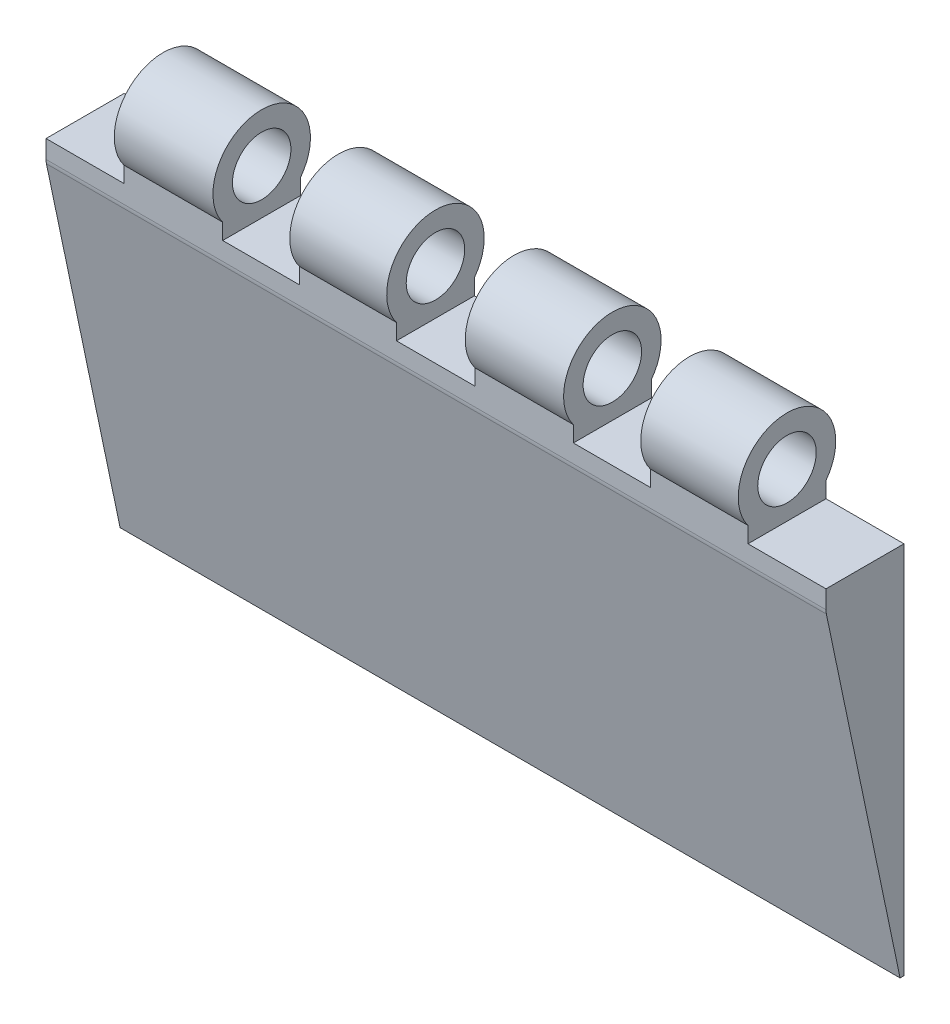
ISO-10303-21;
HEADER;
FILE_DESCRIPTION(('STEP AP214'),'2;1');
FILE_NAME('part.step','',(''),(''),'','','');
FILE_SCHEMA(('AUTOMOTIVE_DESIGN { 1 0 10303 214 1 1 1 1 }'));
ENDSEC;
DATA;
#1=APPLICATION_CONTEXT('core data for automotive mechanical design processes');
#2=APPLICATION_PROTOCOL_DEFINITION('international standard','automotive_design',2000,#1);
#3=PRODUCT_CONTEXT('',#1,'mechanical');
#4=PRODUCT('Part','Part','',(#3));
#5=PRODUCT_RELATED_PRODUCT_CATEGORY('part','',(#4));
#6=PRODUCT_DEFINITION_FORMATION('','',#4);
#7=PRODUCT_DEFINITION_CONTEXT('part definition',#1,'design');
#8=PRODUCT_DEFINITION('design','',#6,#7);
#9=PRODUCT_DEFINITION_SHAPE('','',#8);
#10=(LENGTH_UNIT() NAMED_UNIT(*) SI_UNIT(.MILLI.,.METRE.));
#11=(NAMED_UNIT(*) PLANE_ANGLE_UNIT() SI_UNIT($,.RADIAN.));
#12=(NAMED_UNIT(*) SI_UNIT($,.STERADIAN.) SOLID_ANGLE_UNIT());
#13=UNCERTAINTY_MEASURE_WITH_UNIT(LENGTH_MEASURE(1.E-05),#10,'distance_accuracy_value','');
#14=(GEOMETRIC_REPRESENTATION_CONTEXT(3) GLOBAL_UNCERTAINTY_ASSIGNED_CONTEXT((#13)) GLOBAL_UNIT_ASSIGNED_CONTEXT((#10,
#11,#12)) REPRESENTATION_CONTEXT('',''));
#15=CARTESIAN_POINT('',(0.,0.,0.));
#16=DIRECTION('',(0.,0.,1.));
#17=DIRECTION('',(1.,0.,0.));
#18=AXIS2_PLACEMENT_3D('',#15,#16,#17);
#19=CARTESIAN_POINT('',(47.0710678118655,11.5,0.));
#20=DIRECTION('',(-1.,0.,0.));
#21=DIRECTION('',(0.,0.,1.));
#22=AXIS2_PLACEMENT_3D('',#19,#20,#21);
#23=CYLINDRICAL_SURFACE('',#22,2.5);
#24=CARTESIAN_POINT('',(13.,11.5,0.));
#25=DIRECTION('',(1.,0.,0.));
#26=DIRECTION('',(0.,0.,-1.));
#27=AXIS2_PLACEMENT_3D('',#24,#25,#26);
#28=CIRCLE('',#27,2.5);
#29=CARTESIAN_POINT('',(13.,10.,2.));
#30=VERTEX_POINT('',#29);
#31=CARTESIAN_POINT('',(13.,10.,-2.));
#32=VERTEX_POINT('',#31);
#33=EDGE_CURVE('E290',#30,#32,#28,.F.);
#34=ORIENTED_EDGE('',*,*,#33,.F.);
#35=DIRECTION('',(-1.,0.,0.));
#36=VECTOR('',#35,1.);
#37=CARTESIAN_POINT('',(40.,10.,2.));
#38=LINE('',#37,#36);
#39=CARTESIAN_POINT('',(17.9721464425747,10.,2.));
#40=VERTEX_POINT('',#39);
#41=EDGE_CURVE('E367',#40,#30,#38,.T.);
#42=ORIENTED_EDGE('',*,*,#41,.F.);
#43=CARTESIAN_POINT('',(17.9721464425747,11.5,0.));
#44=DIRECTION('',(-1.,0.,0.));
#45=DIRECTION('',(0.,0.,1.));
#46=AXIS2_PLACEMENT_3D('',#43,#44,#45);
#47=CIRCLE('',#46,2.5);
#48=CARTESIAN_POINT('',(17.9721464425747,10.,-2.));
#49=VERTEX_POINT('',#48);
#50=EDGE_CURVE('E254',#49,#40,#47,.F.);
#51=ORIENTED_EDGE('',*,*,#50,.F.);
#52=DIRECTION('',(-1.,0.,0.));
#53=VECTOR('',#52,1.);
#54=CARTESIAN_POINT('',(40.,10.,-2.));
#55=LINE('',#54,#53);
#56=EDGE_CURVE('E373',#49,#32,#55,.T.);
#57=ORIENTED_EDGE('',*,*,#56,.T.);
#58=EDGE_LOOP('',(#34,#42,#51,#57));
#59=FACE_BOUND('',#58,.T.);
#60=ADVANCED_FACE('F39',(#59),#23,.T.);
#61=CARTESIAN_POINT('',(22.,11.5,0.));
#62=DIRECTION('',(1.,0.,0.));
#63=DIRECTION('',(0.,0.,-1.));
#64=AXIS2_PLACEMENT_3D('',#61,#62,#63);
#65=CIRCLE('',#64,2.5);
#66=CARTESIAN_POINT('',(22.,10.,2.));
#67=VERTEX_POINT('',#66);
#68=CARTESIAN_POINT('',(22.,10.,-2.));
#69=VERTEX_POINT('',#68);
#70=EDGE_CURVE('E266',#67,#69,#65,.F.);
#71=ORIENTED_EDGE('',*,*,#70,.F.);
#72=CARTESIAN_POINT('',(27.0441228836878,10.,2.));
#73=VERTEX_POINT('',#72);
#74=EDGE_CURVE('E460',#73,#67,#38,.T.);
#75=ORIENTED_EDGE('',*,*,#74,.F.);
#76=CARTESIAN_POINT('',(27.0441228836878,11.5,0.));
#77=DIRECTION('',(-1.,0.,0.));
#78=DIRECTION('',(0.,0.,1.));
#79=AXIS2_PLACEMENT_3D('',#76,#77,#78);
#80=CIRCLE('',#79,2.5);
#81=CARTESIAN_POINT('',(27.0441228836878,10.,-2.));
#82=VERTEX_POINT('',#81);
#83=EDGE_CURVE('E226',#82,#73,#80,.F.);
#84=ORIENTED_EDGE('',*,*,#83,.F.);
#85=EDGE_CURVE('E758',#82,#69,#55,.T.);
#86=ORIENTED_EDGE('',*,*,#85,.T.);
#87=EDGE_LOOP('',(#71,#75,#84,#86));
#88=FACE_BOUND('',#87,.T.);
#89=ADVANCED_FACE('F517',(#88),#23,.T.);
#90=CARTESIAN_POINT('',(31.,11.5,0.));
#91=DIRECTION('',(1.,0.,0.));
#92=DIRECTION('',(0.,0.,-1.));
#93=AXIS2_PLACEMENT_3D('',#90,#91,#92);
#94=CIRCLE('',#93,2.5);
#95=CARTESIAN_POINT('',(31.,10.,2.));
#96=VERTEX_POINT('',#95);
#97=CARTESIAN_POINT('',(31.,10.,-2.));
#98=VERTEX_POINT('',#97);
#99=EDGE_CURVE('E243',#96,#98,#94,.F.);
#100=ORIENTED_EDGE('',*,*,#99,.F.);
#101=CARTESIAN_POINT('',(36.,10.,2.));
#102=VERTEX_POINT('',#101);
#103=EDGE_CURVE('E368',#102,#96,#38,.T.);
#104=ORIENTED_EDGE('',*,*,#103,.F.);
#105=CARTESIAN_POINT('',(36.,11.5,0.));
#106=DIRECTION('',(-1.,0.,0.));
#107=DIRECTION('',(0.,0.,1.));
#108=AXIS2_PLACEMENT_3D('',#105,#106,#107);
#109=CIRCLE('',#108,2.5);
#110=CARTESIAN_POINT('',(36.,10.,-2.));
#111=VERTEX_POINT('',#110);
#112=EDGE_CURVE('E228',#111,#102,#109,.F.);
#113=ORIENTED_EDGE('',*,*,#112,.F.);
#114=EDGE_CURVE('E219',#111,#98,#55,.T.);
#115=ORIENTED_EDGE('',*,*,#114,.T.);
#116=EDGE_LOOP('',(#100,#104,#113,#115));
#117=FACE_BOUND('',#116,.T.);
#118=ADVANCED_FACE('F457',(#117),#23,.T.);
#119=CARTESIAN_POINT('',(40.,10.,-2.));
#120=DIRECTION('',(0.,0.,1.));
#121=DIRECTION('',(0.,-1.,0.));
#122=AXIS2_PLACEMENT_3D('',#119,#120,#121);
#123=PLANE('',#122);
#124=DIRECTION('',(1.,0.,0.));
#125=VECTOR('',#124,1.);
#126=CARTESIAN_POINT('',(40.,9.18500534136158,-2.));
#127=LINE('',#126,#125);
#128=CARTESIAN_POINT('',(0.,9.18500534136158,-2.));
#129=VERTEX_POINT('',#128);
#130=CARTESIAN_POINT('',(4.,9.18500534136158,-2.));
#131=VERTEX_POINT('',#130);
#132=EDGE_CURVE('E316',#129,#131,#127,.T.);
#133=ORIENTED_EDGE('',*,*,#132,.T.);
#134=DIRECTION('',(0.,1.,0.));
#135=VECTOR('',#134,1.);
#136=CARTESIAN_POINT('',(4.,10.,-2.));
#137=LINE('',#136,#135);
#138=CARTESIAN_POINT('',(4.,10.,-2.));
#139=VERTEX_POINT('',#138);
#140=EDGE_CURVE('E309',#131,#139,#137,.T.);
#141=ORIENTED_EDGE('',*,*,#140,.T.);
#142=CARTESIAN_POINT('',(9.06026370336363,10.,-2.));
#143=VERTEX_POINT('',#142);
#144=EDGE_CURVE('E369',#143,#139,#55,.T.);
#145=ORIENTED_EDGE('',*,*,#144,.F.);
#146=DIRECTION('',(0.,-1.,0.));
#147=VECTOR('',#146,1.);
#148=CARTESIAN_POINT('',(9.06026370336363,10.,-2.));
#149=LINE('',#148,#147);
#150=CARTESIAN_POINT('',(9.06026370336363,9.18500534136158,-2.));
#151=VERTEX_POINT('',#150);
#152=EDGE_CURVE('E285',#143,#151,#149,.T.);
#153=ORIENTED_EDGE('',*,*,#152,.T.);
#154=DIRECTION('',(1.,0.,0.));
#155=VECTOR('',#154,1.);
#156=CARTESIAN_POINT('',(40.,9.18500534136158,-2.));
#157=LINE('',#156,#155);
#158=CARTESIAN_POINT('',(13.,9.18500534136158,-2.));
#159=VERTEX_POINT('',#158);
#160=EDGE_CURVE('E328',#151,#159,#157,.T.);
#161=ORIENTED_EDGE('',*,*,#160,.T.);
#162=DIRECTION('',(0.,1.,0.));
#163=VECTOR('',#162,1.);
#164=CARTESIAN_POINT('',(13.,10.,-2.));
#165=LINE('',#164,#163);
#166=EDGE_CURVE('E297',#159,#32,#165,.T.);
#167=ORIENTED_EDGE('',*,*,#166,.T.);
#168=ORIENTED_EDGE('',*,*,#56,.F.);
#169=DIRECTION('',(0.,-1.,0.));
#170=VECTOR('',#169,1.);
#171=CARTESIAN_POINT('',(17.9721464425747,10.,-2.));
#172=LINE('',#171,#170);
#173=CARTESIAN_POINT('',(17.9721464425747,9.18500534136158,-2.));
#174=VERTEX_POINT('',#173);
#175=EDGE_CURVE('E261',#49,#174,#172,.T.);
#176=ORIENTED_EDGE('',*,*,#175,.T.);
#177=DIRECTION('',(1.,0.,0.));
#178=VECTOR('',#177,1.);
#179=CARTESIAN_POINT('',(40.,9.18500534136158,-2.));
#180=LINE('',#179,#178);
#181=CARTESIAN_POINT('',(22.,9.18500534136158,-2.));
#182=VERTEX_POINT('',#181);
#183=EDGE_CURVE('E324',#174,#182,#180,.T.);
#184=ORIENTED_EDGE('',*,*,#183,.T.);
#185=DIRECTION('',(0.,1.,0.));
#186=VECTOR('',#185,1.);
#187=CARTESIAN_POINT('',(22.,10.,-2.));
#188=LINE('',#187,#186);
#189=EDGE_CURVE('E273',#182,#69,#188,.T.);
#190=ORIENTED_EDGE('',*,*,#189,.T.);
#191=ORIENTED_EDGE('',*,*,#85,.F.);
#192=DIRECTION('',(0.,-1.,0.));
#193=VECTOR('',#192,1.);
#194=CARTESIAN_POINT('',(27.0441228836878,10.,-2.));
#195=LINE('',#194,#193);
#196=CARTESIAN_POINT('',(27.0441228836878,9.18500534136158,-2.));
#197=VERTEX_POINT('',#196);
#198=EDGE_CURVE('E238',#82,#197,#195,.T.);
#199=ORIENTED_EDGE('',*,*,#198,.T.);
#200=DIRECTION('',(1.,0.,0.));
#201=VECTOR('',#200,1.);
#202=CARTESIAN_POINT('',(40.,9.18500534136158,-2.));
#203=LINE('',#202,#201);
#204=CARTESIAN_POINT('',(31.,9.18500534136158,-2.));
#205=VERTEX_POINT('',#204);
#206=EDGE_CURVE('E202',#197,#205,#203,.T.);
#207=ORIENTED_EDGE('',*,*,#206,.T.);
#208=DIRECTION('',(0.,1.,0.));
#209=VECTOR('',#208,1.);
#210=CARTESIAN_POINT('',(31.,10.,-2.));
#211=LINE('',#210,#209);
#212=EDGE_CURVE('E250',#205,#98,#211,.T.);
#213=ORIENTED_EDGE('',*,*,#212,.T.);
#214=ORIENTED_EDGE('',*,*,#114,.F.);
#215=DIRECTION('',(0.,-1.,0.));
#216=VECTOR('',#215,1.);
#217=CARTESIAN_POINT('',(36.,10.,-2.));
#218=LINE('',#217,#216);
#219=CARTESIAN_POINT('',(36.,9.18500534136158,-2.));
#220=VERTEX_POINT('',#219);
#221=EDGE_CURVE('E207',#111,#220,#218,.T.);
#222=ORIENTED_EDGE('',*,*,#221,.T.);
#223=DIRECTION('',(1.,0.,0.));
#224=VECTOR('',#223,1.);
#225=CARTESIAN_POINT('',(40.,9.18500534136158,-2.));
#226=LINE('',#225,#224);
#227=CARTESIAN_POINT('',(40.,9.18500534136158,-2.));
#228=VERTEX_POINT('',#227);
#229=EDGE_CURVE('E191',#220,#228,#226,.T.);
#230=ORIENTED_EDGE('',*,*,#229,.T.);
#231=DIRECTION('',(0.,1.,0.));
#232=VECTOR('',#231,1.);
#233=CARTESIAN_POINT('',(40.,10.,-2.));
#234=LINE('',#233,#232);
#235=CARTESIAN_POINT('',(40.,-10.,-2.));
#236=VERTEX_POINT('',#235);
#237=EDGE_CURVE('E343',#236,#228,#234,.T.);
#238=ORIENTED_EDGE('',*,*,#237,.F.);
#239=DIRECTION('',(-1.,0.,0.));
#240=VECTOR('',#239,1.);
#241=CARTESIAN_POINT('',(40.,-10.,-2.));
#242=LINE('',#241,#240);
#243=CARTESIAN_POINT('',(0.,-10.,-2.));
#244=VERTEX_POINT('',#243);
#245=EDGE_CURVE('E352',#236,#244,#242,.T.);
#246=ORIENTED_EDGE('',*,*,#245,.T.);
#247=DIRECTION('',(0.,1.,0.));
#248=VECTOR('',#247,1.);
#249=CARTESIAN_POINT('',(0.,10.,-2.));
#250=LINE('',#249,#248);
#251=EDGE_CURVE('E342',#244,#129,#250,.T.);
#252=ORIENTED_EDGE('',*,*,#251,.T.);
#253=EDGE_LOOP('',(#133,#141,#145,#153,#161,#167,#168,#176,#184,#190,#191,#199,#207,#213,#214,
#222,#230,#238,#246,#252));
#254=FACE_BOUND('',#253,.T.);
#255=ADVANCED_FACE('F216',(#254),#123,.F.);
#256=CARTESIAN_POINT('',(40.,10.,2.));
#257=DIRECTION('',(0.,0.,-1.));
#258=DIRECTION('',(0.,1.,0.));
#259=AXIS2_PLACEMENT_3D('',#256,#257,#258);
#260=PLANE('',#259);
#261=CARTESIAN_POINT('',(9.06026370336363,10.,2.));
#262=VERTEX_POINT('',#261);
#263=CARTESIAN_POINT('',(4.,10.,2.));
#264=VERTEX_POINT('',#263);
#265=EDGE_CURVE('E363',#262,#264,#38,.T.);
#266=ORIENTED_EDGE('',*,*,#265,.T.);
#267=DIRECTION('',(0.,-1.,0.));
#268=VECTOR('',#267,1.);
#269=CARTESIAN_POINT('',(4.,10.,2.));
#270=LINE('',#269,#268);
#271=CARTESIAN_POINT('',(4.,9.18500534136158,2.));
#272=VERTEX_POINT('',#271);
#273=EDGE_CURVE('E305',#264,#272,#270,.T.);
#274=ORIENTED_EDGE('',*,*,#273,.T.);
#275=DIRECTION('',(-1.,0.,0.));
#276=VECTOR('',#275,1.);
#277=CARTESIAN_POINT('',(40.,9.18500534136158,2.));
#278=LINE('',#277,#276);
#279=CARTESIAN_POINT('',(0.,9.18500534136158,2.));
#280=VERTEX_POINT('',#279);
#281=EDGE_CURVE('E313',#272,#280,#278,.T.);
#282=ORIENTED_EDGE('',*,*,#281,.T.);
#283=DIRECTION('',(0.,-1.,0.));
#284=VECTOR('',#283,1.);
#285=CARTESIAN_POINT('',(0.,10.,2.));
#286=LINE('',#285,#284);
#287=CARTESIAN_POINT('',(0.,8.2567908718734,2.));
#288=VERTEX_POINT('',#287);
#289=EDGE_CURVE('E62',#280,#288,#286,.T.);
#290=ORIENTED_EDGE('',*,*,#289,.T.);
#291=DIRECTION('',(-1.,0.,0.));
#292=VECTOR('',#291,1.);
#293=CARTESIAN_POINT('',(40.,8.2567908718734,2.));
#294=LINE('',#293,#292);
#295=CARTESIAN_POINT('',(40.,8.2567908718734,2.));
#296=VERTEX_POINT('',#295);
#297=EDGE_CURVE('E381',#288,#296,#294,.F.);
#298=ORIENTED_EDGE('',*,*,#297,.T.);
#299=DIRECTION('',(0.,-1.,0.));
#300=VECTOR('',#299,1.);
#301=CARTESIAN_POINT('',(40.,10.,2.));
#302=LINE('',#301,#300);
#303=CARTESIAN_POINT('',(40.,9.18500534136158,2.));
#304=VERTEX_POINT('',#303);
#305=EDGE_CURVE('E55',#304,#296,#302,.T.);
#306=ORIENTED_EDGE('',*,*,#305,.F.);
#307=DIRECTION('',(-1.,0.,0.));
#308=VECTOR('',#307,1.);
#309=CARTESIAN_POINT('',(40.,9.18500534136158,2.));
#310=LINE('',#309,#308);
#311=CARTESIAN_POINT('',(36.,9.18500534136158,2.));
#312=VERTEX_POINT('',#311);
#313=EDGE_CURVE('E203',#304,#312,#310,.T.);
#314=ORIENTED_EDGE('',*,*,#313,.T.);
#315=DIRECTION('',(0.,1.,0.));
#316=VECTOR('',#315,1.);
#317=CARTESIAN_POINT('',(36.,10.,2.));
#318=LINE('',#317,#316);
#319=EDGE_CURVE('E210',#312,#102,#318,.T.);
#320=ORIENTED_EDGE('',*,*,#319,.T.);
#321=ORIENTED_EDGE('',*,*,#103,.T.);
#322=DIRECTION('',(0.,-1.,0.));
#323=VECTOR('',#322,1.);
#324=CARTESIAN_POINT('',(31.,10.,2.));
#325=LINE('',#324,#323);
#326=CARTESIAN_POINT('',(31.,9.18500534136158,2.));
#327=VERTEX_POINT('',#326);
#328=EDGE_CURVE('E246',#96,#327,#325,.T.);
#329=ORIENTED_EDGE('',*,*,#328,.T.);
#330=DIRECTION('',(-1.,0.,0.));
#331=VECTOR('',#330,1.);
#332=CARTESIAN_POINT('',(40.,9.18500534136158,2.));
#333=LINE('',#332,#331);
#334=CARTESIAN_POINT('',(27.0441228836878,9.18500534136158,2.));
#335=VERTEX_POINT('',#334);
#336=EDGE_CURVE('E416',#327,#335,#333,.T.);
#337=ORIENTED_EDGE('',*,*,#336,.T.);
#338=DIRECTION('',(0.,1.,0.));
#339=VECTOR('',#338,1.);
#340=CARTESIAN_POINT('',(27.0441228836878,10.,2.));
#341=LINE('',#340,#339);
#342=EDGE_CURVE('E234',#335,#73,#341,.T.);
#343=ORIENTED_EDGE('',*,*,#342,.T.);
#344=ORIENTED_EDGE('',*,*,#74,.T.);
#345=DIRECTION('',(0.,-1.,0.));
#346=VECTOR('',#345,1.);
#347=CARTESIAN_POINT('',(22.,10.,2.));
#348=LINE('',#347,#346);
#349=CARTESIAN_POINT('',(22.,9.18500534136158,2.));
#350=VERTEX_POINT('',#349);
#351=EDGE_CURVE('E269',#67,#350,#348,.T.);
#352=ORIENTED_EDGE('',*,*,#351,.T.);
#353=DIRECTION('',(-1.,0.,0.));
#354=VECTOR('',#353,1.);
#355=CARTESIAN_POINT('',(40.,9.18500534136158,2.));
#356=LINE('',#355,#354);
#357=CARTESIAN_POINT('',(17.9721464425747,9.18500534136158,2.));
#358=VERTEX_POINT('',#357);
#359=EDGE_CURVE('E48',#350,#358,#356,.T.);
#360=ORIENTED_EDGE('',*,*,#359,.T.);
#361=DIRECTION('',(0.,1.,0.));
#362=VECTOR('',#361,1.);
#363=CARTESIAN_POINT('',(17.9721464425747,10.,2.));
#364=LINE('',#363,#362);
#365=EDGE_CURVE('E257',#358,#40,#364,.T.);
#366=ORIENTED_EDGE('',*,*,#365,.T.);
#367=ORIENTED_EDGE('',*,*,#41,.T.);
#368=DIRECTION('',(0.,-1.,0.));
#369=VECTOR('',#368,1.);
#370=CARTESIAN_POINT('',(13.,10.,2.));
#371=LINE('',#370,#369);
#372=CARTESIAN_POINT('',(13.,9.18500534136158,2.));
#373=VERTEX_POINT('',#372);
#374=EDGE_CURVE('E293',#30,#373,#371,.T.);
#375=ORIENTED_EDGE('',*,*,#374,.T.);
#376=DIRECTION('',(-1.,0.,0.));
#377=VECTOR('',#376,1.);
#378=CARTESIAN_POINT('',(40.,9.18500534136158,2.));
#379=LINE('',#378,#377);
#380=CARTESIAN_POINT('',(9.06026370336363,9.18500534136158,2.));
#381=VERTEX_POINT('',#380);
#382=EDGE_CURVE('E11',#373,#381,#379,.T.);
#383=ORIENTED_EDGE('',*,*,#382,.T.);
#384=DIRECTION('',(0.,1.,0.));
#385=VECTOR('',#384,1.);
#386=CARTESIAN_POINT('',(9.06026370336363,10.,2.));
#387=LINE('',#386,#385);
#388=EDGE_CURVE('E281',#381,#262,#387,.T.);
#389=ORIENTED_EDGE('',*,*,#388,.T.);
#390=EDGE_LOOP('',(#266,#274,#282,#290,#298,#306,#314,#320,#321,#329,#337,#343,#344,#352,#360,
#366,#367,#375,#383,#389));
#391=FACE_BOUND('',#390,.T.);
#392=ADVANCED_FACE('F421',(#391),#260,.F.);
#393=CARTESIAN_POINT('',(40.,-10.,2.));
#394=DIRECTION('',(0.,1.,0.));
#395=DIRECTION('',(0.,0.,1.));
#396=AXIS2_PLACEMENT_3D('',#393,#394,#395);
#397=PLANE('',#396);
#398=DIRECTION('',(0.,0.,-1.));
#399=VECTOR('',#398,1.);
#400=CARTESIAN_POINT('',(40.,-10.,2.));
#401=LINE('',#400,#399);
#402=CARTESIAN_POINT('',(40.,-10.,-1.8));
#403=VERTEX_POINT('',#402);
#404=EDGE_CURVE('E349',#403,#236,#401,.T.);
#405=ORIENTED_EDGE('',*,*,#404,.F.);
#406=DIRECTION('',(-1.,0.,0.));
#407=VECTOR('',#406,1.);
#408=CARTESIAN_POINT('',(40.,-10.,-1.8));
#409=LINE('',#408,#407);
#410=CARTESIAN_POINT('',(0.,-10.,-1.8));
#411=VERTEX_POINT('',#410);
#412=EDGE_CURVE('E336',#403,#411,#409,.T.);
#413=ORIENTED_EDGE('',*,*,#412,.T.);
#414=DIRECTION('',(0.,0.,-1.));
#415=VECTOR('',#414,1.);
#416=CARTESIAN_POINT('',(0.,-10.,2.));
#417=LINE('',#416,#415);
#418=EDGE_CURVE('E346',#411,#244,#417,.T.);
#419=ORIENTED_EDGE('',*,*,#418,.T.);
#420=ORIENTED_EDGE('',*,*,#245,.F.);
#421=EDGE_LOOP('',(#405,#413,#419,#420));
#422=FACE_BOUND('',#421,.T.);
#423=ADVANCED_FACE('F506',(#422),#397,.F.);
#424=CARTESIAN_POINT('',(40.,0.,0.));
#425=DIRECTION('',(1.,0.,0.));
#426=DIRECTION('',(0.,0.,-1.));
#427=AXIS2_PLACEMENT_3D('',#424,#425,#426);
#428=PLANE('',#427);
#429=DIRECTION('',(0.,0.,-1.));
#430=VECTOR('',#429,1.);
#431=CARTESIAN_POINT('',(40.,9.18500534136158,0.));
#432=LINE('',#431,#430);
#433=EDGE_CURVE('E196',#304,#228,#432,.T.);
#434=ORIENTED_EDGE('',*,*,#433,.F.);
#435=ORIENTED_EDGE('',*,*,#305,.T.);
#436=CARTESIAN_POINT('',(40.,8.2567908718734,1.));
#437=DIRECTION('',(1.,0.,0.));
#438=DIRECTION('',(0.,0.,-1.));
#439=AXIS2_PLACEMENT_3D('',#436,#437,#438);
#440=CIRCLE('',#439,1.);
#441=CARTESIAN_POINT('',(40.,8.05190277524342,1.97878540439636));
#442=VERTEX_POINT('',#441);
#443=EDGE_CURVE('E384',#296,#442,#440,.T.);
#444=ORIENTED_EDGE('',*,*,#443,.T.);
#445=DIRECTION('',(0.,-0.978785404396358,-0.204888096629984));
#446=VECTOR('',#445,1.);
#447=CARTESIAN_POINT('',(40.,8.15324851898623,2.));
#448=LINE('',#447,#446);
#449=EDGE_CURVE('E333',#442,#403,#448,.T.);
#450=ORIENTED_EDGE('',*,*,#449,.T.);
#451=ORIENTED_EDGE('',*,*,#404,.T.);
#452=ORIENTED_EDGE('',*,*,#237,.T.);
#453=EDGE_LOOP('',(#434,#435,#444,#450,#451,#452));
#454=FACE_BOUND('',#453,.T.);
#455=ADVANCED_FACE('F499',(#454),#428,.T.);
#456=CARTESIAN_POINT('',(0.,0.,0.));
#457=DIRECTION('',(1.,0.,0.));
#458=DIRECTION('',(0.,0.,-1.));
#459=AXIS2_PLACEMENT_3D('',#456,#457,#458);
#460=PLANE('',#459);
#461=ORIENTED_EDGE('',*,*,#289,.F.);
#462=DIRECTION('',(0.,0.,-1.));
#463=VECTOR('',#462,1.);
#464=CARTESIAN_POINT('',(0.,9.18500534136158,0.));
#465=LINE('',#464,#463);
#466=EDGE_CURVE('E387',#280,#129,#465,.T.);
#467=ORIENTED_EDGE('',*,*,#466,.T.);
#468=ORIENTED_EDGE('',*,*,#251,.F.);
#469=ORIENTED_EDGE('',*,*,#418,.F.);
#470=DIRECTION('',(0.,-0.978785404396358,-0.204888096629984));
#471=VECTOR('',#470,1.);
#472=CARTESIAN_POINT('',(0.,8.15324851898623,2.));
#473=LINE('',#472,#471);
#474=CARTESIAN_POINT('',(0.,8.05190277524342,1.97878540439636));
#475=VERTEX_POINT('',#474);
#476=EDGE_CURVE('E332',#475,#411,#473,.T.);
#477=ORIENTED_EDGE('',*,*,#476,.F.);
#478=CARTESIAN_POINT('',(0.,8.2567908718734,1.));
#479=DIRECTION('',(1.,0.,0.));
#480=DIRECTION('',(0.,0.,-1.));
#481=AXIS2_PLACEMENT_3D('',#478,#479,#480);
#482=CIRCLE('',#481,1.);
#483=EDGE_CURVE('E378',#475,#288,#482,.F.);
#484=ORIENTED_EDGE('',*,*,#483,.T.);
#485=EDGE_LOOP('',(#461,#467,#468,#469,#477,#484));
#486=FACE_BOUND('',#485,.T.);
#487=ADVANCED_FACE('F491',(#486),#460,.F.);
#488=CARTESIAN_POINT('',(4.,11.5,0.));
#489=DIRECTION('',(1.,0.,0.));
#490=DIRECTION('',(0.,0.,-1.));
#491=AXIS2_PLACEMENT_3D('',#488,#489,#490);
#492=CIRCLE('',#491,2.5);
#493=EDGE_CURVE('E302',#264,#139,#492,.F.);
#494=ORIENTED_EDGE('',*,*,#493,.F.);
#495=ORIENTED_EDGE('',*,*,#265,.F.);
#496=CARTESIAN_POINT('',(9.06026370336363,11.5,0.));
#497=DIRECTION('',(-1.,0.,0.));
#498=DIRECTION('',(0.,0.,1.));
#499=AXIS2_PLACEMENT_3D('',#496,#497,#498);
#500=CIRCLE('',#499,2.5);
#501=EDGE_CURVE('E278',#143,#262,#500,.F.);
#502=ORIENTED_EDGE('',*,*,#501,.F.);
#503=ORIENTED_EDGE('',*,*,#144,.T.);
#504=EDGE_LOOP('',(#494,#495,#502,#503));
#505=FACE_BOUND('',#504,.T.);
#506=ADVANCED_FACE('F486',(#505),#23,.T.);
#507=CARTESIAN_POINT('',(40.,8.15324851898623,2.));
#508=DIRECTION('',(0.,0.204888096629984,-0.978785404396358));
#509=DIRECTION('',(0.,0.978785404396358,0.204888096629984));
#510=AXIS2_PLACEMENT_3D('',#507,#508,#509);
#511=PLANE('',#510);
#512=ORIENTED_EDGE('',*,*,#449,.F.);
#513=DIRECTION('',(-1.,0.,0.));
#514=VECTOR('',#513,1.);
#515=CARTESIAN_POINT('',(40.,8.05190277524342,1.97878540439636));
#516=LINE('',#515,#514);
#517=EDGE_CURVE('E374',#442,#475,#516,.T.);
#518=ORIENTED_EDGE('',*,*,#517,.T.);
#519=ORIENTED_EDGE('',*,*,#476,.T.);
#520=ORIENTED_EDGE('',*,*,#412,.F.);
#521=EDGE_LOOP('',(#512,#518,#519,#520));
#522=FACE_BOUND('',#521,.T.);
#523=ADVANCED_FACE('F502',(#522),#511,.F.);
#524=CARTESIAN_POINT('',(40.,8.2567908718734,1.));
#525=DIRECTION('',(-1.,0.,0.));
#526=DIRECTION('',(0.,0.,1.));
#527=AXIS2_PLACEMENT_3D('',#524,#525,#526);
#528=CYLINDRICAL_SURFACE('',#527,1.);
#529=ORIENTED_EDGE('',*,*,#443,.F.);
#530=ORIENTED_EDGE('',*,*,#297,.F.);
#531=ORIENTED_EDGE('',*,*,#483,.F.);
#532=ORIENTED_EDGE('',*,*,#517,.F.);
#533=EDGE_LOOP('',(#529,#530,#531,#532));
#534=FACE_BOUND('',#533,.T.);
#535=ADVANCED_FACE('F41',(#534),#528,.T.);
#536=CARTESIAN_POINT('',(36.,9.18500534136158,-2.5));
#537=DIRECTION('',(0.,-1.,0.));
#538=DIRECTION('',(0.,0.,-1.));
#539=AXIS2_PLACEMENT_3D('',#536,#537,#538);
#540=PLANE('',#539);
#541=DIRECTION('',(0.,0.,1.));
#542=VECTOR('',#541,1.);
#543=CARTESIAN_POINT('',(36.,9.18500534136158,-2.5));
#544=LINE('',#543,#542);
#545=EDGE_CURVE('E194',#220,#312,#544,.T.);
#546=ORIENTED_EDGE('',*,*,#545,.T.);
#547=ORIENTED_EDGE('',*,*,#313,.F.);
#548=ORIENTED_EDGE('',*,*,#433,.T.);
#549=ORIENTED_EDGE('',*,*,#229,.F.);
#550=EDGE_LOOP('',(#546,#547,#548,#549));
#551=FACE_BOUND('',#550,.T.);
#552=ADVANCED_FACE('F193',(#551),#540,.F.);
#553=CARTESIAN_POINT('',(36.,9.18500534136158,-2.5));
#554=DIRECTION('',(-1.,0.,0.));
#555=DIRECTION('',(0.,0.,1.));
#556=AXIS2_PLACEMENT_3D('',#553,#554,#555);
#557=PLANE('',#556);
#558=CARTESIAN_POINT('',(36.,11.5,0.));
#559=DIRECTION('',(-1.,0.,0.));
#560=DIRECTION('',(0.,0.,1.));
#561=AXIS2_PLACEMENT_3D('',#558,#559,#560);
#562=CIRCLE('',#561,1.5);
#563=CARTESIAN_POINT('',(36.,11.5,1.5));
#564=VERTEX_POINT('',#563);
#565=EDGE_CURVE('E388',#564,#564,#562,.F.);
#566=ORIENTED_EDGE('',*,*,#565,.F.);
#567=EDGE_LOOP('',(#566));
#568=FACE_BOUND('',#567,.T.);
#569=ORIENTED_EDGE('',*,*,#112,.T.);
#570=ORIENTED_EDGE('',*,*,#319,.F.);
#571=ORIENTED_EDGE('',*,*,#545,.F.);
#572=ORIENTED_EDGE('',*,*,#221,.F.);
#573=EDGE_LOOP('',(#569,#570,#571,#572));
#574=FACE_BOUND('',#573,.T.);
#575=ADVANCED_FACE('F206',(#568,#574),#557,.F.);
#576=CARTESIAN_POINT('',(31.,9.18500534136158,-2.5));
#577=DIRECTION('',(0.,-1.,0.));
#578=DIRECTION('',(0.,0.,-1.));
#579=AXIS2_PLACEMENT_3D('',#576,#577,#578);
#580=PLANE('',#579);
#581=DIRECTION('',(0.,0.,1.));
#582=VECTOR('',#581,1.);
#583=CARTESIAN_POINT('',(27.0441228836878,9.18500534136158,-2.5));
#584=LINE('',#583,#582);
#585=EDGE_CURVE('E212',#197,#335,#584,.T.);
#586=ORIENTED_EDGE('',*,*,#585,.T.);
#587=ORIENTED_EDGE('',*,*,#336,.F.);
#588=DIRECTION('',(0.,0.,1.));
#589=VECTOR('',#588,1.);
#590=CARTESIAN_POINT('',(31.,9.18500534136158,-2.5));
#591=LINE('',#590,#589);
#592=EDGE_CURVE('E444',#205,#327,#591,.T.);
#593=ORIENTED_EDGE('',*,*,#592,.F.);
#594=ORIENTED_EDGE('',*,*,#206,.F.);
#595=EDGE_LOOP('',(#586,#587,#593,#594));
#596=FACE_BOUND('',#595,.T.);
#597=ADVANCED_FACE('F579',(#596),#580,.F.);
#598=CARTESIAN_POINT('',(31.,9.18500534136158,-2.5));
#599=DIRECTION('',(1.,0.,0.));
#600=DIRECTION('',(0.,0.,-1.));
#601=AXIS2_PLACEMENT_3D('',#598,#599,#600);
#602=PLANE('',#601);
#603=CARTESIAN_POINT('',(31.,11.5,0.));
#604=DIRECTION('',(1.,0.,0.));
#605=DIRECTION('',(0.,0.,-1.));
#606=AXIS2_PLACEMENT_3D('',#603,#604,#605);
#607=CIRCLE('',#606,1.5);
#608=CARTESIAN_POINT('',(31.,11.5,-1.5));
#609=VERTEX_POINT('',#608);
#610=EDGE_CURVE('E242',#609,#609,#607,.F.);
#611=ORIENTED_EDGE('',*,*,#610,.F.);
#612=EDGE_LOOP('',(#611));
#613=FACE_BOUND('',#612,.T.);
#614=ORIENTED_EDGE('',*,*,#592,.T.);
#615=ORIENTED_EDGE('',*,*,#328,.F.);
#616=ORIENTED_EDGE('',*,*,#99,.T.);
#617=ORIENTED_EDGE('',*,*,#212,.F.);
#618=EDGE_LOOP('',(#614,#615,#616,#617));
#619=FACE_BOUND('',#618,.T.);
#620=ADVANCED_FACE('F589',(#613,#619),#602,.F.);
#621=CARTESIAN_POINT('',(27.0441228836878,9.18500534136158,-2.5));
#622=DIRECTION('',(-1.,0.,0.));
#623=DIRECTION('',(0.,0.,1.));
#624=AXIS2_PLACEMENT_3D('',#621,#622,#623);
#625=PLANE('',#624);
#626=CARTESIAN_POINT('',(27.0441228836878,11.5,0.));
#627=DIRECTION('',(-1.,0.,0.));
#628=DIRECTION('',(0.,0.,1.));
#629=AXIS2_PLACEMENT_3D('',#626,#627,#628);
#630=CIRCLE('',#629,1.5);
#631=CARTESIAN_POINT('',(27.0441228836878,11.5,1.5));
#632=VERTEX_POINT('',#631);
#633=EDGE_CURVE('E221',#632,#632,#630,.F.);
#634=ORIENTED_EDGE('',*,*,#633,.F.);
#635=EDGE_LOOP('',(#634));
#636=FACE_BOUND('',#635,.T.);
#637=ORIENTED_EDGE('',*,*,#83,.T.);
#638=ORIENTED_EDGE('',*,*,#342,.F.);
#639=ORIENTED_EDGE('',*,*,#585,.F.);
#640=ORIENTED_EDGE('',*,*,#198,.F.);
#641=EDGE_LOOP('',(#637,#638,#639,#640));
#642=FACE_BOUND('',#641,.T.);
#643=ADVANCED_FACE('F599',(#636,#642),#625,.F.);
#644=CARTESIAN_POINT('',(22.,9.18500534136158,-2.5));
#645=DIRECTION('',(0.,-1.,0.));
#646=DIRECTION('',(0.,0.,-1.));
#647=AXIS2_PLACEMENT_3D('',#644,#645,#646);
#648=PLANE('',#647);
#649=DIRECTION('',(0.,0.,1.));
#650=VECTOR('',#649,1.);
#651=CARTESIAN_POINT('',(17.9721464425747,9.18500534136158,-2.5));
#652=LINE('',#651,#650);
#653=EDGE_CURVE('E433',#174,#358,#652,.T.);
#654=ORIENTED_EDGE('',*,*,#653,.T.);
#655=ORIENTED_EDGE('',*,*,#359,.F.);
#656=DIRECTION('',(0.,0.,1.));
#657=VECTOR('',#656,1.);
#658=CARTESIAN_POINT('',(22.,9.18500534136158,-2.5));
#659=LINE('',#658,#657);
#660=EDGE_CURVE('E431',#182,#350,#659,.T.);
#661=ORIENTED_EDGE('',*,*,#660,.F.);
#662=ORIENTED_EDGE('',*,*,#183,.F.);
#663=EDGE_LOOP('',(#654,#655,#661,#662));
#664=FACE_BOUND('',#663,.T.);
#665=ADVANCED_FACE('F430',(#664),#648,.F.);
#666=CARTESIAN_POINT('',(22.,9.18500534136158,-2.5));
#667=DIRECTION('',(1.,0.,0.));
#668=DIRECTION('',(0.,0.,-1.));
#669=AXIS2_PLACEMENT_3D('',#666,#667,#668);
#670=PLANE('',#669);
#671=CARTESIAN_POINT('',(22.,11.5,0.));
#672=DIRECTION('',(1.,0.,0.));
#673=DIRECTION('',(0.,0.,-1.));
#674=AXIS2_PLACEMENT_3D('',#671,#672,#673);
#675=CIRCLE('',#674,1.5);
#676=CARTESIAN_POINT('',(22.,11.5,-1.5));
#677=VERTEX_POINT('',#676);
#678=EDGE_CURVE('E265',#677,#677,#675,.F.);
#679=ORIENTED_EDGE('',*,*,#678,.F.);
#680=EDGE_LOOP('',(#679));
#681=FACE_BOUND('',#680,.T.);
#682=ORIENTED_EDGE('',*,*,#660,.T.);
#683=ORIENTED_EDGE('',*,*,#351,.F.);
#684=ORIENTED_EDGE('',*,*,#70,.T.);
#685=ORIENTED_EDGE('',*,*,#189,.F.);
#686=EDGE_LOOP('',(#682,#683,#684,#685));
#687=FACE_BOUND('',#686,.T.);
#688=ADVANCED_FACE('F435',(#681,#687),#670,.F.);
#689=CARTESIAN_POINT('',(17.9721464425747,9.18500534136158,-2.5));
#690=DIRECTION('',(-1.,0.,0.));
#691=DIRECTION('',(0.,0.,1.));
#692=AXIS2_PLACEMENT_3D('',#689,#690,#691);
#693=PLANE('',#692);
#694=CARTESIAN_POINT('',(17.9721464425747,11.5,0.));
#695=DIRECTION('',(-1.,0.,0.));
#696=DIRECTION('',(0.,0.,1.));
#697=AXIS2_PLACEMENT_3D('',#694,#695,#696);
#698=CIRCLE('',#697,1.5);
#699=CARTESIAN_POINT('',(17.9721464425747,11.5,1.5));
#700=VERTEX_POINT('',#699);
#701=EDGE_CURVE('E253',#700,#700,#698,.F.);
#702=ORIENTED_EDGE('',*,*,#701,.F.);
#703=EDGE_LOOP('',(#702));
#704=FACE_BOUND('',#703,.T.);
#705=ORIENTED_EDGE('',*,*,#50,.T.);
#706=ORIENTED_EDGE('',*,*,#365,.F.);
#707=ORIENTED_EDGE('',*,*,#653,.F.);
#708=ORIENTED_EDGE('',*,*,#175,.F.);
#709=EDGE_LOOP('',(#705,#706,#707,#708));
#710=FACE_BOUND('',#709,.T.);
#711=ADVANCED_FACE('F626',(#704,#710),#693,.F.);
#712=CARTESIAN_POINT('',(13.,9.18500534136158,-2.5));
#713=DIRECTION('',(0.,-1.,0.));
#714=DIRECTION('',(0.,0.,-1.));
#715=AXIS2_PLACEMENT_3D('',#712,#713,#714);
#716=PLANE('',#715);
#717=DIRECTION('',(0.,0.,1.));
#718=VECTOR('',#717,1.);
#719=CARTESIAN_POINT('',(9.06026370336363,9.18500534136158,-2.5));
#720=LINE('',#719,#718);
#721=EDGE_CURVE('E437',#151,#381,#720,.T.);
#722=ORIENTED_EDGE('',*,*,#721,.T.);
#723=ORIENTED_EDGE('',*,*,#382,.F.);
#724=DIRECTION('',(0.,0.,1.));
#725=VECTOR('',#724,1.);
#726=CARTESIAN_POINT('',(13.,9.18500534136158,-2.5));
#727=LINE('',#726,#725);
#728=EDGE_CURVE('E442',#159,#373,#727,.T.);
#729=ORIENTED_EDGE('',*,*,#728,.F.);
#730=ORIENTED_EDGE('',*,*,#160,.F.);
#731=EDGE_LOOP('',(#722,#723,#729,#730));
#732=FACE_BOUND('',#731,.T.);
#733=ADVANCED_FACE('F636',(#732),#716,.F.);
#734=CARTESIAN_POINT('',(13.,9.18500534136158,-2.5));
#735=DIRECTION('',(1.,0.,0.));
#736=DIRECTION('',(0.,0.,-1.));
#737=AXIS2_PLACEMENT_3D('',#734,#735,#736);
#738=PLANE('',#737);
#739=CARTESIAN_POINT('',(13.,11.5,0.));
#740=DIRECTION('',(1.,0.,0.));
#741=DIRECTION('',(0.,0.,-1.));
#742=AXIS2_PLACEMENT_3D('',#739,#740,#741);
#743=CIRCLE('',#742,1.5);
#744=CARTESIAN_POINT('',(13.,11.5,-1.5));
#745=VERTEX_POINT('',#744);
#746=EDGE_CURVE('E289',#745,#745,#743,.F.);
#747=ORIENTED_EDGE('',*,*,#746,.F.);
#748=EDGE_LOOP('',(#747));
#749=FACE_BOUND('',#748,.T.);
#750=ORIENTED_EDGE('',*,*,#728,.T.);
#751=ORIENTED_EDGE('',*,*,#374,.F.);
#752=ORIENTED_EDGE('',*,*,#33,.T.);
#753=ORIENTED_EDGE('',*,*,#166,.F.);
#754=EDGE_LOOP('',(#750,#751,#752,#753));
#755=FACE_BOUND('',#754,.T.);
#756=ADVANCED_FACE('F471',(#749,#755),#738,.F.);
#757=CARTESIAN_POINT('',(9.06026370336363,9.18500534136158,-2.5));
#758=DIRECTION('',(-1.,0.,0.));
#759=DIRECTION('',(0.,0.,1.));
#760=AXIS2_PLACEMENT_3D('',#757,#758,#759);
#761=PLANE('',#760);
#762=CARTESIAN_POINT('',(9.06026370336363,11.5,0.));
#763=DIRECTION('',(-1.,0.,0.));
#764=DIRECTION('',(0.,0.,1.));
#765=AXIS2_PLACEMENT_3D('',#762,#763,#764);
#766=CIRCLE('',#765,1.5);
#767=CARTESIAN_POINT('',(9.06026370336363,11.5,1.5));
#768=VERTEX_POINT('',#767);
#769=EDGE_CURVE('E277',#768,#768,#766,.F.);
#770=ORIENTED_EDGE('',*,*,#769,.F.);
#771=EDGE_LOOP('',(#770));
#772=FACE_BOUND('',#771,.T.);
#773=ORIENTED_EDGE('',*,*,#501,.T.);
#774=ORIENTED_EDGE('',*,*,#388,.F.);
#775=ORIENTED_EDGE('',*,*,#721,.F.);
#776=ORIENTED_EDGE('',*,*,#152,.F.);
#777=EDGE_LOOP('',(#773,#774,#775,#776));
#778=FACE_BOUND('',#777,.T.);
#779=ADVANCED_FACE('F654',(#772,#778),#761,.F.);
#780=CARTESIAN_POINT('',(4.,9.18500534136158,-2.5));
#781=DIRECTION('',(0.,-1.,0.));
#782=DIRECTION('',(0.,0.,-1.));
#783=AXIS2_PLACEMENT_3D('',#780,#781,#782);
#784=PLANE('',#783);
#785=ORIENTED_EDGE('',*,*,#466,.F.);
#786=ORIENTED_EDGE('',*,*,#281,.F.);
#787=DIRECTION('',(0.,0.,1.));
#788=VECTOR('',#787,1.);
#789=CARTESIAN_POINT('',(4.,9.18500534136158,-2.5));
#790=LINE('',#789,#788);
#791=EDGE_CURVE('E391',#131,#272,#790,.T.);
#792=ORIENTED_EDGE('',*,*,#791,.F.);
#793=ORIENTED_EDGE('',*,*,#132,.F.);
#794=EDGE_LOOP('',(#785,#786,#792,#793));
#795=FACE_BOUND('',#794,.T.);
#796=ADVANCED_FACE('F489',(#795),#784,.F.);
#797=CARTESIAN_POINT('',(4.,9.18500534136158,-2.5));
#798=DIRECTION('',(1.,0.,0.));
#799=DIRECTION('',(0.,0.,-1.));
#800=AXIS2_PLACEMENT_3D('',#797,#798,#799);
#801=PLANE('',#800);
#802=CARTESIAN_POINT('',(4.,11.5,0.));
#803=DIRECTION('',(1.,0.,0.));
#804=DIRECTION('',(0.,0.,-1.));
#805=AXIS2_PLACEMENT_3D('',#802,#803,#804);
#806=CIRCLE('',#805,1.5);
#807=CARTESIAN_POINT('',(4.,11.5,-1.5));
#808=VERTEX_POINT('',#807);
#809=EDGE_CURVE('E301',#808,#808,#806,.F.);
#810=ORIENTED_EDGE('',*,*,#809,.F.);
#811=EDGE_LOOP('',(#810));
#812=FACE_BOUND('',#811,.T.);
#813=ORIENTED_EDGE('',*,*,#791,.T.);
#814=ORIENTED_EDGE('',*,*,#273,.F.);
#815=ORIENTED_EDGE('',*,*,#493,.T.);
#816=ORIENTED_EDGE('',*,*,#140,.F.);
#817=EDGE_LOOP('',(#813,#814,#815,#816));
#818=FACE_BOUND('',#817,.T.);
#819=ADVANCED_FACE('F481',(#812,#818),#801,.F.);
#820=CARTESIAN_POINT('',(47.0710678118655,11.5,0.));
#821=DIRECTION('',(-1.,0.,0.));
#822=DIRECTION('',(0.,0.,1.));
#823=AXIS2_PLACEMENT_3D('',#820,#821,#822);
#824=CYLINDRICAL_SURFACE('',#823,1.5);
#825=ORIENTED_EDGE('',*,*,#610,.T.);
#826=EDGE_LOOP('',(#825));
#827=FACE_BOUND('',#826,.T.);
#828=ORIENTED_EDGE('',*,*,#565,.T.);
#829=EDGE_LOOP('',(#828));
#830=FACE_BOUND('',#829,.T.);
#831=ADVANCED_FACE('F681',(#827,#830),#824,.F.);
#832=ORIENTED_EDGE('',*,*,#678,.T.);
#833=EDGE_LOOP('',(#832));
#834=FACE_BOUND('',#833,.T.);
#835=ORIENTED_EDGE('',*,*,#633,.T.);
#836=EDGE_LOOP('',(#835));
#837=FACE_BOUND('',#836,.T.);
#838=ADVANCED_FACE('F691',(#834,#837),#824,.F.);
#839=ORIENTED_EDGE('',*,*,#746,.T.);
#840=EDGE_LOOP('',(#839));
#841=FACE_BOUND('',#840,.T.);
#842=ORIENTED_EDGE('',*,*,#701,.T.);
#843=EDGE_LOOP('',(#842));
#844=FACE_BOUND('',#843,.T.);
#845=ADVANCED_FACE('F702',(#841,#844),#824,.F.);
#846=ORIENTED_EDGE('',*,*,#809,.T.);
#847=EDGE_LOOP('',(#846));
#848=FACE_BOUND('',#847,.T.);
#849=ORIENTED_EDGE('',*,*,#769,.T.);
#850=EDGE_LOOP('',(#849));
#851=FACE_BOUND('',#850,.T.);
#852=ADVANCED_FACE('F693',(#848,#851),#824,.F.);
#853=CLOSED_SHELL('',(#60,#89,#118,#255,#392,#423,#455,#487,#506,#523,#535,#552,#575,#597,#620,
#643,#665,#688,#711,#733,#756,#779,#796,#819,#831,#838,#845,#852));
#854=MANIFOLD_SOLID_BREP('B2',#853);
#855=ADVANCED_BREP_SHAPE_REPRESENTATION('',(#18,#854),#14);
#856=SHAPE_DEFINITION_REPRESENTATION(#9,#855);
ENDSEC;
END-ISO-10303-21;
